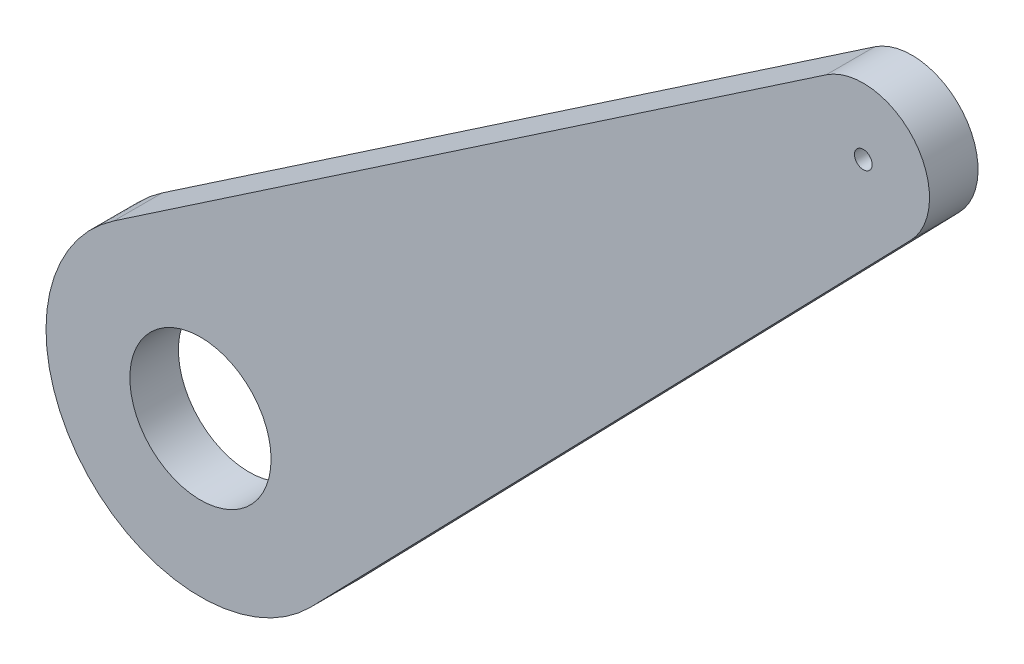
ISO-10303-21;
HEADER;
FILE_DESCRIPTION(('STEP AP214'),'2;1');
FILE_NAME('part.step','',(''),(''),'','','');
FILE_SCHEMA(('AUTOMOTIVE_DESIGN { 1 0 10303 214 1 1 1 1 }'));
ENDSEC;
DATA;
#1=APPLICATION_CONTEXT('core data for automotive mechanical design processes');
#2=APPLICATION_PROTOCOL_DEFINITION('international standard','automotive_design',2000,#1);
#3=PRODUCT_CONTEXT('',#1,'mechanical');
#4=PRODUCT('Part','Part','',(#3));
#5=PRODUCT_RELATED_PRODUCT_CATEGORY('part','',(#4));
#6=PRODUCT_DEFINITION_FORMATION('','',#4);
#7=PRODUCT_DEFINITION_CONTEXT('part definition',#1,'design');
#8=PRODUCT_DEFINITION('design','',#6,#7);
#9=PRODUCT_DEFINITION_SHAPE('','',#8);
#10=(LENGTH_UNIT() NAMED_UNIT(*) SI_UNIT(.MILLI.,.METRE.));
#11=(NAMED_UNIT(*) PLANE_ANGLE_UNIT() SI_UNIT($,.RADIAN.));
#12=(NAMED_UNIT(*) SI_UNIT($,.STERADIAN.) SOLID_ANGLE_UNIT());
#13=UNCERTAINTY_MEASURE_WITH_UNIT(LENGTH_MEASURE(1.E-05),#10,'distance_accuracy_value','');
#14=(GEOMETRIC_REPRESENTATION_CONTEXT(3) GLOBAL_UNCERTAINTY_ASSIGNED_CONTEXT((#13)) GLOBAL_UNIT_ASSIGNED_CONTEXT((#10,
#11,#12)) REPRESENTATION_CONTEXT('',''));
#15=CARTESIAN_POINT('',(0.,0.,0.));
#16=DIRECTION('',(0.,0.,1.));
#17=DIRECTION('',(1.,0.,0.));
#18=AXIS2_PLACEMENT_3D('',#15,#16,#17);
#19=CARTESIAN_POINT('',(0.,0.,5.5));
#20=DIRECTION('',(0.,0.,-1.));
#21=DIRECTION('',(-1.,0.,0.));
#22=AXIS2_PLACEMENT_3D('',#19,#20,#21);
#23=CYLINDRICAL_SURFACE('',#22,8.);
#24=CARTESIAN_POINT('',(0.,0.,5.5));
#25=DIRECTION('',(0.,0.,1.));
#26=DIRECTION('',(1.,0.,0.));
#27=AXIS2_PLACEMENT_3D('',#24,#25,#26);
#28=CIRCLE('',#27,8.);
#29=CARTESIAN_POINT('',(8.,0.,5.5));
#30=VERTEX_POINT('',#29);
#31=EDGE_CURVE('E130',#30,#30,#28,.T.);
#32=ORIENTED_EDGE('',*,*,#31,.T.);
#33=EDGE_LOOP('',(#32));
#34=FACE_BOUND('',#33,.T.);
#35=CARTESIAN_POINT('',(0.,0.,0.));
#36=DIRECTION('',(0.,0.,1.));
#37=DIRECTION('',(1.,0.,0.));
#38=AXIS2_PLACEMENT_3D('',#35,#36,#37);
#39=CIRCLE('',#38,8.);
#40=CARTESIAN_POINT('',(8.,0.,0.));
#41=VERTEX_POINT('',#40);
#42=EDGE_CURVE('E147',#41,#41,#39,.T.);
#43=ORIENTED_EDGE('',*,*,#42,.F.);
#44=EDGE_LOOP('',(#43));
#45=FACE_BOUND('',#44,.T.);
#46=ADVANCED_FACE('F69',(#34,#45),#23,.F.);
#47=CARTESIAN_POINT('',(0.,0.,0.));
#48=DIRECTION('',(0.,0.,1.));
#49=DIRECTION('',(1.,0.,0.));
#50=AXIS2_PLACEMENT_3D('',#47,#48,#49);
#51=PLANE('',#50);
#52=CARTESIAN_POINT('',(0.,0.,0.));
#53=DIRECTION('',(0.,0.,1.));
#54=DIRECTION('',(1.,0.,0.));
#55=AXIS2_PLACEMENT_3D('',#52,#53,#54);
#56=CIRCLE('',#55,17.5);
#57=CARTESIAN_POINT('',(-9.816598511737,14.4873873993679,0.));
#58=VERTEX_POINT('',#57);
#59=CARTESIAN_POINT('',(12.5533480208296,-12.1927623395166,0.));
#60=VERTEX_POINT('',#59);
#61=EDGE_CURVE('E145',#58,#60,#56,.T.);
#62=ORIENTED_EDGE('',*,*,#61,.F.);
#63=DIRECTION('',(-0.827850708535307,-0.560948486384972,0.));
#64=VECTOR('',#63,1.);
#65=CARTESIAN_POINT('',(-9.81659851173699,14.4873873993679,0.));
#66=LINE('',#65,#64);
#67=CARTESIAN_POINT('',(70.8892928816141,69.1733919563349,0.));
#68=VERTEX_POINT('',#67);
#69=EDGE_CURVE('E143',#68,#58,#66,.T.);
#70=ORIENTED_EDGE('',*,*,#69,.F.);
#71=CARTESIAN_POINT('',(75.0964065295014,62.9645116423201,0.));
#72=DIRECTION('',(0.,0.,1.));
#73=DIRECTION('',(1.,0.,0.));
#74=AXIS2_PLACEMENT_3D('',#71,#72,#73);
#75=CIRCLE('',#74,7.50000000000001);
#76=CARTESIAN_POINT('',(80.4764128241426,57.7390420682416,0.));
#77=VERTEX_POINT('',#76);
#78=EDGE_CURVE('E124',#77,#68,#75,.T.);
#79=ORIENTED_EDGE('',*,*,#78,.F.);
#80=DIRECTION('',(-0.696729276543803,-0.717334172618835,0.));
#81=VECTOR('',#80,1.);
#82=CARTESIAN_POINT('',(12.5533480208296,-12.1927623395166,0.));
#83=LINE('',#82,#81);
#84=EDGE_CURVE('E139',#77,#60,#83,.T.);
#85=ORIENTED_EDGE('',*,*,#84,.T.);
#86=EDGE_LOOP('',(#62,#70,#79,#85));
#87=FACE_BOUND('',#86,.T.);
#88=ORIENTED_EDGE('',*,*,#42,.T.);
#89=EDGE_LOOP('',(#88));
#90=FACE_BOUND('',#89,.T.);
#91=CARTESIAN_POINT('',(75.0964065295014,62.9645116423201,0.));
#92=DIRECTION('',(0.,0.,1.));
#93=DIRECTION('',(1.,0.,0.));
#94=AXIS2_PLACEMENT_3D('',#91,#92,#93);
#95=CIRCLE('',#94,0.999999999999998);
#96=CARTESIAN_POINT('',(76.0964065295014,62.9645116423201,0.));
#97=VERTEX_POINT('',#96);
#98=EDGE_CURVE('E150',#97,#97,#95,.T.);
#99=ORIENTED_EDGE('',*,*,#98,.T.);
#100=EDGE_LOOP('',(#99));
#101=FACE_BOUND('',#100,.T.);
#102=ADVANCED_FACE('F164',(#87,#90,#101),#51,.F.);
#103=CARTESIAN_POINT('',(0.,0.,5.5));
#104=DIRECTION('',(0.,0.,-1.));
#105=DIRECTION('',(-1.,0.,0.));
#106=AXIS2_PLACEMENT_3D('',#103,#104,#105);
#107=CYLINDRICAL_SURFACE('',#106,17.5);
#108=ORIENTED_EDGE('',*,*,#61,.T.);
#109=DIRECTION('',(0.,0.,-1.));
#110=VECTOR('',#109,1.);
#111=CARTESIAN_POINT('',(12.5533480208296,-12.1927623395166,5.5));
#112=LINE('',#111,#110);
#113=CARTESIAN_POINT('',(12.5533480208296,-12.1927623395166,5.5));
#114=VERTEX_POINT('',#113);
#115=EDGE_CURVE('E86',#114,#60,#112,.T.);
#116=ORIENTED_EDGE('',*,*,#115,.F.);
#117=CARTESIAN_POINT('',(0.,0.,5.5));
#118=DIRECTION('',(0.,0.,1.));
#119=DIRECTION('',(1.,0.,0.));
#120=AXIS2_PLACEMENT_3D('',#117,#118,#119);
#121=CIRCLE('',#120,17.5);
#122=CARTESIAN_POINT('',(-9.816598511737,14.4873873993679,5.5));
#123=VERTEX_POINT('',#122);
#124=EDGE_CURVE('E128',#123,#114,#121,.T.);
#125=ORIENTED_EDGE('',*,*,#124,.F.);
#126=DIRECTION('',(0.,0.,-1.));
#127=VECTOR('',#126,1.);
#128=CARTESIAN_POINT('',(-9.816598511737,14.4873873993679,5.5));
#129=LINE('',#128,#127);
#130=EDGE_CURVE('E99',#123,#58,#129,.T.);
#131=ORIENTED_EDGE('',*,*,#130,.T.);
#132=EDGE_LOOP('',(#108,#116,#125,#131));
#133=FACE_BOUND('',#132,.T.);
#134=ADVANCED_FACE('F161',(#133),#107,.T.);
#135=CARTESIAN_POINT('',(0.,0.,5.5));
#136=DIRECTION('',(0.,0.,1.));
#137=DIRECTION('',(1.,0.,0.));
#138=AXIS2_PLACEMENT_3D('',#135,#136,#137);
#139=PLANE('',#138);
#140=ORIENTED_EDGE('',*,*,#124,.T.);
#141=DIRECTION('',(-0.696729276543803,-0.717334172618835,0.));
#142=VECTOR('',#141,1.);
#143=CARTESIAN_POINT('',(12.5533480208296,-12.1927623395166,5.5));
#144=LINE('',#143,#142);
#145=CARTESIAN_POINT('',(80.4764128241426,57.7390420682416,5.5));
#146=VERTEX_POINT('',#145);
#147=EDGE_CURVE('E118',#146,#114,#144,.T.);
#148=ORIENTED_EDGE('',*,*,#147,.F.);
#149=CARTESIAN_POINT('',(75.0964065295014,62.9645116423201,5.5));
#150=DIRECTION('',(0.,0.,1.));
#151=DIRECTION('',(1.,0.,0.));
#152=AXIS2_PLACEMENT_3D('',#149,#150,#151);
#153=CIRCLE('',#152,7.50000000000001);
#154=CARTESIAN_POINT('',(70.8892928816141,69.1733919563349,5.5));
#155=VERTEX_POINT('',#154);
#156=EDGE_CURVE('E112',#146,#155,#153,.T.);
#157=ORIENTED_EDGE('',*,*,#156,.T.);
#158=DIRECTION('',(-0.827850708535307,-0.560948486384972,0.));
#159=VECTOR('',#158,1.);
#160=CARTESIAN_POINT('',(-9.81659851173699,14.4873873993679,5.5));
#161=LINE('',#160,#159);
#162=EDGE_CURVE('E117',#155,#123,#161,.T.);
#163=ORIENTED_EDGE('',*,*,#162,.T.);
#164=EDGE_LOOP('',(#140,#148,#157,#163));
#165=FACE_BOUND('',#164,.T.);
#166=ORIENTED_EDGE('',*,*,#31,.F.);
#167=EDGE_LOOP('',(#166));
#168=FACE_BOUND('',#167,.T.);
#169=CARTESIAN_POINT('',(75.0964065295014,62.9645116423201,5.5));
#170=DIRECTION('',(0.,0.,1.));
#171=DIRECTION('',(1.,0.,0.));
#172=AXIS2_PLACEMENT_3D('',#169,#170,#171);
#173=CIRCLE('',#172,0.999999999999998);
#174=CARTESIAN_POINT('',(76.0964065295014,62.9645116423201,5.5));
#175=VERTEX_POINT('',#174);
#176=EDGE_CURVE('E136',#175,#175,#173,.T.);
#177=ORIENTED_EDGE('',*,*,#176,.F.);
#178=EDGE_LOOP('',(#177));
#179=FACE_BOUND('',#178,.T.);
#180=ADVANCED_FACE('F114',(#165,#168,#179),#139,.T.);
#181=CARTESIAN_POINT('',(12.5533480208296,-12.1927623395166,5.5));
#182=DIRECTION('',(0.717334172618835,-0.696729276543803,0.));
#183=DIRECTION('',(0.696729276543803,0.717334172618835,0.));
#184=AXIS2_PLACEMENT_3D('',#181,#182,#183);
#185=PLANE('',#184);
#186=ORIENTED_EDGE('',*,*,#84,.F.);
#187=DIRECTION('',(0.,0.,-1.));
#188=VECTOR('',#187,1.);
#189=CARTESIAN_POINT('',(80.4764128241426,57.7390420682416,5.5));
#190=LINE('',#189,#188);
#191=EDGE_CURVE('E12',#146,#77,#190,.T.);
#192=ORIENTED_EDGE('',*,*,#191,.F.);
#193=ORIENTED_EDGE('',*,*,#147,.T.);
#194=ORIENTED_EDGE('',*,*,#115,.T.);
#195=EDGE_LOOP('',(#186,#192,#193,#194));
#196=FACE_BOUND('',#195,.T.);
#197=ADVANCED_FACE('F71',(#196),#185,.T.);
#198=CARTESIAN_POINT('',(75.0964065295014,62.9645116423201,5.5));
#199=DIRECTION('',(0.,0.,-1.));
#200=DIRECTION('',(-1.,0.,0.));
#201=AXIS2_PLACEMENT_3D('',#198,#199,#200);
#202=CYLINDRICAL_SURFACE('',#201,7.50000000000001);
#203=ORIENTED_EDGE('',*,*,#78,.T.);
#204=DIRECTION('',(0.,0.,-1.));
#205=VECTOR('',#204,1.);
#206=CARTESIAN_POINT('',(70.8892928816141,69.1733919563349,5.5));
#207=LINE('',#206,#205);
#208=EDGE_CURVE('E78',#155,#68,#207,.T.);
#209=ORIENTED_EDGE('',*,*,#208,.F.);
#210=ORIENTED_EDGE('',*,*,#156,.F.);
#211=ORIENTED_EDGE('',*,*,#191,.T.);
#212=EDGE_LOOP('',(#203,#209,#210,#211));
#213=FACE_BOUND('',#212,.T.);
#214=ADVANCED_FACE('F122',(#213),#202,.T.);
#215=CARTESIAN_POINT('',(-9.81659851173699,14.4873873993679,5.5));
#216=DIRECTION('',(0.560948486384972,-0.827850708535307,0.));
#217=DIRECTION('',(0.827850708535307,0.560948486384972,0.));
#218=AXIS2_PLACEMENT_3D('',#215,#216,#217);
#219=PLANE('',#218);
#220=ORIENTED_EDGE('',*,*,#69,.T.);
#221=ORIENTED_EDGE('',*,*,#130,.F.);
#222=ORIENTED_EDGE('',*,*,#162,.F.);
#223=ORIENTED_EDGE('',*,*,#208,.T.);
#224=EDGE_LOOP('',(#220,#221,#222,#223));
#225=FACE_BOUND('',#224,.T.);
#226=ADVANCED_FACE('F127',(#225),#219,.F.);
#227=CARTESIAN_POINT('',(75.0964065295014,62.9645116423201,5.5));
#228=DIRECTION('',(0.,0.,-1.));
#229=DIRECTION('',(-1.,0.,0.));
#230=AXIS2_PLACEMENT_3D('',#227,#228,#229);
#231=CYLINDRICAL_SURFACE('',#230,0.999999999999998);
#232=ORIENTED_EDGE('',*,*,#176,.T.);
#233=EDGE_LOOP('',(#232));
#234=FACE_BOUND('',#233,.T.);
#235=ORIENTED_EDGE('',*,*,#98,.F.);
#236=EDGE_LOOP('',(#235));
#237=FACE_BOUND('',#236,.T.);
#238=ADVANCED_FACE('F174',(#234,#237),#231,.F.);
#239=CLOSED_SHELL('',(#46,#102,#134,#180,#197,#214,#226,#238));
#240=MANIFOLD_SOLID_BREP('B2',#239);
#241=ADVANCED_BREP_SHAPE_REPRESENTATION('',(#18,#240),#14);
#242=SHAPE_DEFINITION_REPRESENTATION(#9,#241);
ENDSEC;
END-ISO-10303-21;
